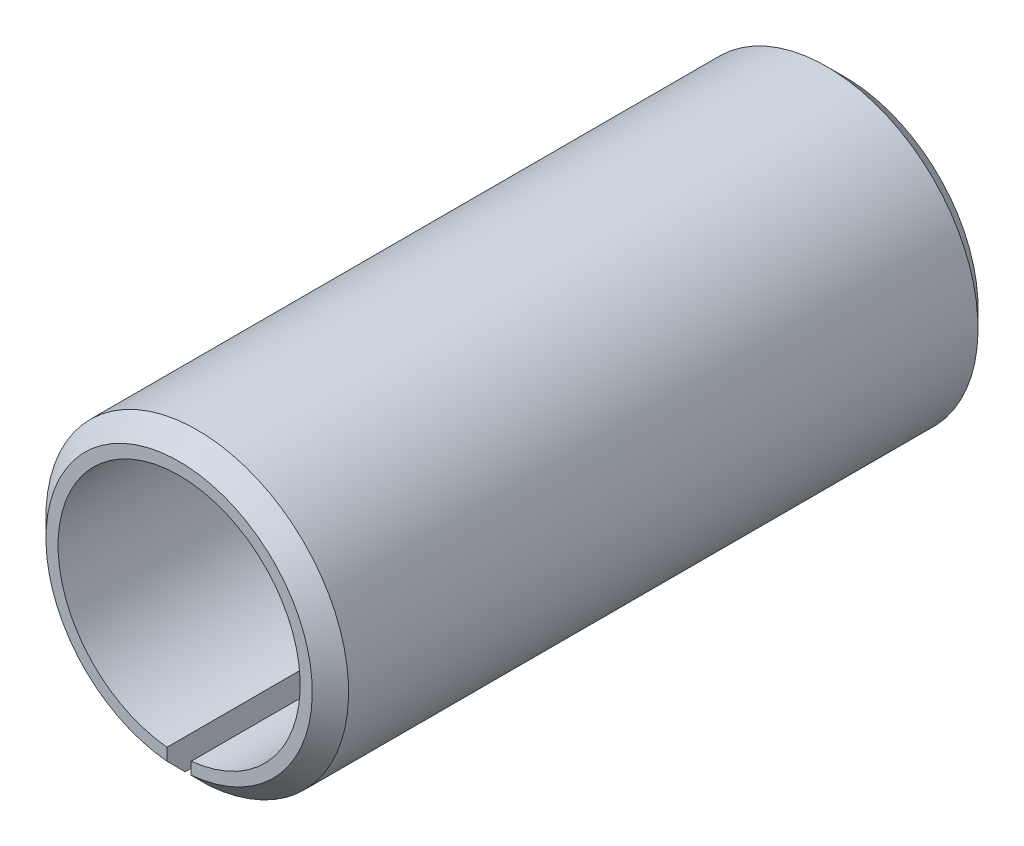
ISO-10303-21;
HEADER;
FILE_DESCRIPTION(('STEP AP214'),'2;1');
FILE_NAME('part.step','',(''),(''),'','','');
FILE_SCHEMA(('AUTOMOTIVE_DESIGN { 1 0 10303 214 1 1 1 1 }'));
ENDSEC;
DATA;
#1=APPLICATION_CONTEXT('core data for automotive mechanical design processes');
#2=APPLICATION_PROTOCOL_DEFINITION('international standard','automotive_design',2000,#1);
#3=PRODUCT_CONTEXT('',#1,'mechanical');
#4=PRODUCT('Part','Part','',(#3));
#5=PRODUCT_RELATED_PRODUCT_CATEGORY('part','',(#4));
#6=PRODUCT_DEFINITION_FORMATION('','',#4);
#7=PRODUCT_DEFINITION_CONTEXT('part definition',#1,'design');
#8=PRODUCT_DEFINITION('design','',#6,#7);
#9=PRODUCT_DEFINITION_SHAPE('','',#8);
#10=(LENGTH_UNIT() NAMED_UNIT(*) SI_UNIT(.MILLI.,.METRE.));
#11=(NAMED_UNIT(*) PLANE_ANGLE_UNIT() SI_UNIT($,.RADIAN.));
#12=(NAMED_UNIT(*) SI_UNIT($,.STERADIAN.) SOLID_ANGLE_UNIT());
#13=UNCERTAINTY_MEASURE_WITH_UNIT(LENGTH_MEASURE(1.E-05),#10,'distance_accuracy_value','');
#14=(GEOMETRIC_REPRESENTATION_CONTEXT(3) GLOBAL_UNCERTAINTY_ASSIGNED_CONTEXT((#13)) GLOBAL_UNIT_ASSIGNED_CONTEXT((#10,
#11,#12)) REPRESENTATION_CONTEXT('',''));
#15=CARTESIAN_POINT('',(0.,0.,0.));
#16=DIRECTION('',(0.,0.,1.));
#17=DIRECTION('',(1.,0.,0.));
#18=AXIS2_PLACEMENT_3D('',#15,#16,#17);
#19=CARTESIAN_POINT('',(0.,0.,11.));
#20=DIRECTION('',(0.,0.,-1.));
#21=DIRECTION('',(-1.,0.,0.));
#22=AXIS2_PLACEMENT_3D('',#19,#20,#21);
#23=CYLINDRICAL_SURFACE('',#22,2.5);
#24=DIRECTION('',(0.,0.,-1.));
#25=VECTOR('',#24,1.);
#26=CARTESIAN_POINT('',(0.2,-2.49198715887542,11.));
#27=LINE('',#26,#25);
#28=CARTESIAN_POINT('',(0.2,-2.49198715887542,10.7));
#29=VERTEX_POINT('',#28);
#30=CARTESIAN_POINT('',(0.2,-2.49198715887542,0.300000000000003));
#31=VERTEX_POINT('',#30);
#32=EDGE_CURVE('E112',#29,#31,#27,.T.);
#33=ORIENTED_EDGE('',*,*,#32,.T.);
#34=CARTESIAN_POINT('',(0.,0.,0.300000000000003));
#35=DIRECTION('',(0.,0.,1.));
#36=DIRECTION('',(1.,0.,0.));
#37=AXIS2_PLACEMENT_3D('',#34,#35,#36);
#38=CIRCLE('',#37,2.5);
#39=CARTESIAN_POINT('',(-0.2,-2.49198715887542,0.300000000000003));
#40=VERTEX_POINT('',#39);
#41=EDGE_CURVE('E125',#31,#40,#38,.T.);
#42=ORIENTED_EDGE('',*,*,#41,.T.);
#43=DIRECTION('',(0.,0.,-1.));
#44=VECTOR('',#43,1.);
#45=CARTESIAN_POINT('',(-0.2,-2.49198715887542,11.));
#46=LINE('',#45,#44);
#47=CARTESIAN_POINT('',(-0.2,-2.49198715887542,10.7));
#48=VERTEX_POINT('',#47);
#49=EDGE_CURVE('E105',#48,#40,#46,.T.);
#50=ORIENTED_EDGE('',*,*,#49,.F.);
#51=CARTESIAN_POINT('',(0.,0.,10.7));
#52=DIRECTION('',(0.,0.,1.));
#53=DIRECTION('',(1.,0.,0.));
#54=AXIS2_PLACEMENT_3D('',#51,#52,#53);
#55=CIRCLE('',#54,2.5);
#56=EDGE_CURVE('E123',#48,#29,#55,.F.);
#57=ORIENTED_EDGE('',*,*,#56,.T.);
#58=EDGE_LOOP('',(#33,#42,#50,#57));
#59=FACE_BOUND('',#58,.T.);
#60=ADVANCED_FACE('F31',(#59),#23,.T.);
#61=CARTESIAN_POINT('',(-0.2,-1.98997487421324,11.));
#62=DIRECTION('',(-1.,0.,0.));
#63=DIRECTION('',(0.,-1.,0.));
#64=AXIS2_PLACEMENT_3D('',#61,#62,#63);
#65=PLANE('',#64);
#66=ORIENTED_EDGE('',*,*,#49,.T.);
#67=CARTESIAN_POINT('',(-0.2,-2.49198715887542,0.300000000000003));
#68=CARTESIAN_POINT('',(-0.2,-2.44181602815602,0.24998826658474));
#69=CARTESIAN_POINT('',(-0.2,-2.39163905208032,0.199982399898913));
#70=CARTESIAN_POINT('',(-0.2,-2.29127340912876,0.0999823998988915));
#71=CARTESIAN_POINT('',(-0.2,-2.24108474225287,0.0499882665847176));
#72=CARTESIAN_POINT('',(-0.2,-2.19089023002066,0.));
#73=B_SPLINE_CURVE_WITH_KNOTS('',3,(#67,#68,#69,#70,#71,#72),.UNSPECIFIED.,.F.,.F.,(4,2,4),(0.,
0.212520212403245,0.425040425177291),.UNSPECIFIED.);
#74=CARTESIAN_POINT('',(-0.2,-2.19089023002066,0.));
#75=VERTEX_POINT('',#74);
#76=EDGE_CURVE('E134',#40,#75,#73,.T.);
#77=ORIENTED_EDGE('',*,*,#76,.T.);
#78=DIRECTION('',(0.,1.,0.));
#79=VECTOR('',#78,1.);
#80=CARTESIAN_POINT('',(-0.2,-1.98997487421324,0.));
#81=LINE('',#80,#79);
#82=CARTESIAN_POINT('',(-0.2,-1.98997487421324,0.));
#83=VERTEX_POINT('',#82);
#84=EDGE_CURVE('E102',#75,#83,#81,.T.);
#85=ORIENTED_EDGE('',*,*,#84,.T.);
#86=DIRECTION('',(0.,0.,-1.));
#87=VECTOR('',#86,1.);
#88=CARTESIAN_POINT('',(-0.2,-1.98997487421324,11.));
#89=LINE('',#88,#87);
#90=CARTESIAN_POINT('',(-0.2,-1.98997487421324,11.));
#91=VERTEX_POINT('',#90);
#92=EDGE_CURVE('E99',#91,#83,#89,.T.);
#93=ORIENTED_EDGE('',*,*,#92,.F.);
#94=DIRECTION('',(0.,1.,0.));
#95=VECTOR('',#94,1.);
#96=CARTESIAN_POINT('',(-0.2,-1.98997487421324,11.));
#97=LINE('',#96,#95);
#98=CARTESIAN_POINT('',(-0.2,-2.19089023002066,11.));
#99=VERTEX_POINT('',#98);
#100=EDGE_CURVE('E88',#99,#91,#97,.T.);
#101=ORIENTED_EDGE('',*,*,#100,.F.);
#102=CARTESIAN_POINT('',(-0.2,-2.19089023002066,11.));
#103=CARTESIAN_POINT('',(-0.2,-2.24108474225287,10.9500117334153));
#104=CARTESIAN_POINT('',(-0.2,-2.29127340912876,10.9000176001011));
#105=CARTESIAN_POINT('',(-0.2,-2.39163905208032,10.8000176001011));
#106=CARTESIAN_POINT('',(-0.2,-2.44181602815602,10.7500117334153));
#107=CARTESIAN_POINT('',(-0.2,-2.49198715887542,10.7));
#108=B_SPLINE_CURVE_WITH_KNOTS('',3,(#102,#103,#104,#105,#106,#107),.UNSPECIFIED.,.F.,.F.,(4,2,
4),(0.,0.212520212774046,0.425040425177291),.UNSPECIFIED.);
#109=EDGE_CURVE('E128',#99,#48,#108,.T.);
#110=ORIENTED_EDGE('',*,*,#109,.T.);
#111=EDGE_LOOP('',(#66,#77,#85,#93,#101,#110));
#112=FACE_BOUND('',#111,.T.);
#113=ADVANCED_FACE('F101',(#112),#65,.F.);
#114=CARTESIAN_POINT('',(0.,0.,11.));
#115=DIRECTION('',(0.,0.,-1.));
#116=DIRECTION('',(-1.,0.,0.));
#117=AXIS2_PLACEMENT_3D('',#114,#115,#116);
#118=CYLINDRICAL_SURFACE('',#117,2.);
#119=CARTESIAN_POINT('',(0.,0.,0.));
#120=DIRECTION('',(0.,0.,-1.));
#121=DIRECTION('',(1.,0.,0.));
#122=AXIS2_PLACEMENT_3D('',#119,#120,#121);
#123=CIRCLE('',#122,2.);
#124=CARTESIAN_POINT('',(0.2,-1.98997487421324,0.));
#125=VERTEX_POINT('',#124);
#126=EDGE_CURVE('E116',#83,#125,#123,.T.);
#127=ORIENTED_EDGE('',*,*,#126,.T.);
#128=DIRECTION('',(0.,0.,-1.));
#129=VECTOR('',#128,1.);
#130=CARTESIAN_POINT('',(0.2,-1.98997487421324,11.));
#131=LINE('',#130,#129);
#132=CARTESIAN_POINT('',(0.2,-1.98997487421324,11.));
#133=VERTEX_POINT('',#132);
#134=EDGE_CURVE('E106',#133,#125,#131,.T.);
#135=ORIENTED_EDGE('',*,*,#134,.F.);
#136=CARTESIAN_POINT('',(0.,0.,11.));
#137=DIRECTION('',(0.,0.,-1.));
#138=DIRECTION('',(1.,0.,0.));
#139=AXIS2_PLACEMENT_3D('',#136,#137,#138);
#140=CIRCLE('',#139,2.);
#141=EDGE_CURVE('E92',#91,#133,#140,.T.);
#142=ORIENTED_EDGE('',*,*,#141,.F.);
#143=ORIENTED_EDGE('',*,*,#92,.T.);
#144=EDGE_LOOP('',(#127,#135,#142,#143));
#145=FACE_BOUND('',#144,.T.);
#146=ADVANCED_FACE('F108',(#145),#118,.F.);
#147=CARTESIAN_POINT('',(0.2,-1.98997487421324,11.));
#148=DIRECTION('',(1.,0.,0.));
#149=DIRECTION('',(0.,1.,0.));
#150=AXIS2_PLACEMENT_3D('',#147,#148,#149);
#151=PLANE('',#150);
#152=DIRECTION('',(0.,-1.,0.));
#153=VECTOR('',#152,1.);
#154=CARTESIAN_POINT('',(0.2,-1.98997487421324,0.));
#155=LINE('',#154,#153);
#156=CARTESIAN_POINT('',(0.2,-2.19089023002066,0.));
#157=VERTEX_POINT('',#156);
#158=EDGE_CURVE('E96',#125,#157,#155,.T.);
#159=ORIENTED_EDGE('',*,*,#158,.T.);
#160=CARTESIAN_POINT('',(0.2,-2.19089023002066,0.));
#161=CARTESIAN_POINT('',(0.2,-2.24108474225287,0.0499882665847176));
#162=CARTESIAN_POINT('',(0.2,-2.29127340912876,0.0999823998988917));
#163=CARTESIAN_POINT('',(0.2,-2.39163905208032,0.199982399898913));
#164=CARTESIAN_POINT('',(0.2,-2.44181602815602,0.24998826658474));
#165=CARTESIAN_POINT('',(0.2,-2.49198715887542,0.300000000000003));
#166=B_SPLINE_CURVE_WITH_KNOTS('',3,(#160,#161,#162,#163,#164,#165),.UNSPECIFIED.,.F.,.F.,(4,2,
4),(0.,0.212520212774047,0.425040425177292),.UNSPECIFIED.);
#167=EDGE_CURVE('E40',#157,#31,#166,.T.);
#168=ORIENTED_EDGE('',*,*,#167,.T.);
#169=ORIENTED_EDGE('',*,*,#32,.F.);
#170=CARTESIAN_POINT('',(0.2,-2.49198715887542,10.7));
#171=CARTESIAN_POINT('',(0.2,-2.44181602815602,10.7500117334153));
#172=CARTESIAN_POINT('',(0.2,-2.39163905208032,10.8000176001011));
#173=CARTESIAN_POINT('',(0.2,-2.29127340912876,10.9000176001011));
#174=CARTESIAN_POINT('',(0.2,-2.24108474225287,10.9500117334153));
#175=CARTESIAN_POINT('',(0.2,-2.19089023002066,11.));
#176=B_SPLINE_CURVE_WITH_KNOTS('',3,(#170,#171,#172,#173,#174,#175),.UNSPECIFIED.,.F.,.F.,(4,2,
4),(0.,0.212520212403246,0.425040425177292),.UNSPECIFIED.);
#177=CARTESIAN_POINT('',(0.2,-2.19089023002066,11.));
#178=VERTEX_POINT('',#177);
#179=EDGE_CURVE('E47',#29,#178,#176,.T.);
#180=ORIENTED_EDGE('',*,*,#179,.T.);
#181=DIRECTION('',(0.,-1.,0.));
#182=VECTOR('',#181,1.);
#183=CARTESIAN_POINT('',(0.2,-1.98997487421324,11.));
#184=LINE('',#183,#182);
#185=EDGE_CURVE('E110',#133,#178,#184,.T.);
#186=ORIENTED_EDGE('',*,*,#185,.F.);
#187=ORIENTED_EDGE('',*,*,#134,.T.);
#188=EDGE_LOOP('',(#159,#168,#169,#180,#186,#187));
#189=FACE_BOUND('',#188,.T.);
#190=ADVANCED_FACE('F160',(#189),#151,.F.);
#191=CARTESIAN_POINT('',(0.,0.,11.));
#192=DIRECTION('',(0.,0.,1.));
#193=DIRECTION('',(1.,0.,0.));
#194=AXIS2_PLACEMENT_3D('',#191,#192,#193);
#195=PLANE('',#194);
#196=ORIENTED_EDGE('',*,*,#185,.T.);
#197=CARTESIAN_POINT('',(0.,0.,11.));
#198=DIRECTION('',(0.,0.,1.));
#199=DIRECTION('',(1.,0.,0.));
#200=AXIS2_PLACEMENT_3D('',#197,#198,#199);
#201=CIRCLE('',#200,2.2);
#202=EDGE_CURVE('E11',#178,#99,#201,.T.);
#203=ORIENTED_EDGE('',*,*,#202,.T.);
#204=ORIENTED_EDGE('',*,*,#100,.T.);
#205=ORIENTED_EDGE('',*,*,#141,.T.);
#206=EDGE_LOOP('',(#196,#203,#204,#205));
#207=FACE_BOUND('',#206,.T.);
#208=ADVANCED_FACE('F90',(#207),#195,.T.);
#209=CARTESIAN_POINT('',(0.,0.,0.));
#210=DIRECTION('',(0.,0.,1.));
#211=DIRECTION('',(1.,0.,0.));
#212=AXIS2_PLACEMENT_3D('',#209,#210,#211);
#213=PLANE('',#212);
#214=ORIENTED_EDGE('',*,*,#84,.F.);
#215=CARTESIAN_POINT('',(0.,0.,0.));
#216=DIRECTION('',(0.,0.,1.));
#217=DIRECTION('',(1.,0.,0.));
#218=AXIS2_PLACEMENT_3D('',#215,#216,#217);
#219=CIRCLE('',#218,2.2);
#220=EDGE_CURVE('E55',#75,#157,#219,.F.);
#221=ORIENTED_EDGE('',*,*,#220,.T.);
#222=ORIENTED_EDGE('',*,*,#158,.F.);
#223=ORIENTED_EDGE('',*,*,#126,.F.);
#224=EDGE_LOOP('',(#214,#221,#222,#223));
#225=FACE_BOUND('',#224,.T.);
#226=ADVANCED_FACE('F150',(#225),#213,.F.);
#227=CARTESIAN_POINT('',(0.,0.,0.300000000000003));
#228=DIRECTION('',(0.,0.,1.));
#229=DIRECTION('',(1.,0.,0.));
#230=AXIS2_PLACEMENT_3D('',#227,#228,#229);
#231=CONICAL_SURFACE('',#230,2.5,0.785398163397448);
#232=ORIENTED_EDGE('',*,*,#167,.F.);
#233=ORIENTED_EDGE('',*,*,#220,.F.);
#234=ORIENTED_EDGE('',*,*,#76,.F.);
#235=ORIENTED_EDGE('',*,*,#41,.F.);
#236=EDGE_LOOP('',(#232,#233,#234,#235));
#237=FACE_BOUND('',#236,.T.);
#238=ADVANCED_FACE('F147',(#237),#231,.T.);
#239=CARTESIAN_POINT('',(0.,0.,11.));
#240=DIRECTION('',(0.,0.,-1.));
#241=DIRECTION('',(-1.,0.,0.));
#242=AXIS2_PLACEMENT_3D('',#239,#240,#241);
#243=CONICAL_SURFACE('',#242,2.2,0.785398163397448);
#244=ORIENTED_EDGE('',*,*,#179,.F.);
#245=ORIENTED_EDGE('',*,*,#56,.F.);
#246=ORIENTED_EDGE('',*,*,#109,.F.);
#247=ORIENTED_EDGE('',*,*,#202,.F.);
#248=EDGE_LOOP('',(#244,#245,#246,#247));
#249=FACE_BOUND('',#248,.T.);
#250=ADVANCED_FACE('F33',(#249),#243,.T.);
#251=CLOSED_SHELL('',(#60,#113,#146,#190,#208,#226,#238,#250));
#252=MANIFOLD_SOLID_BREP('B2',#251);
#253=ADVANCED_BREP_SHAPE_REPRESENTATION('',(#18,#252),#14);
#254=SHAPE_DEFINITION_REPRESENTATION(#9,#253);
ENDSEC;
END-ISO-10303-21;
